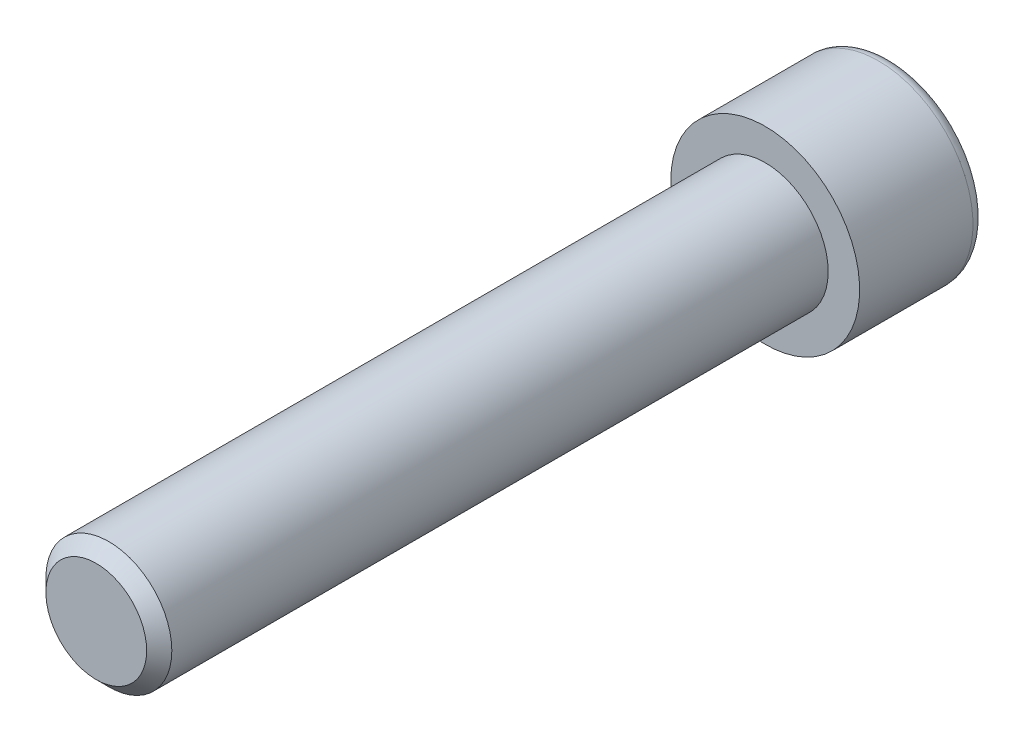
ISO-10303-21;
HEADER;
FILE_DESCRIPTION(('STEP AP214'),'2;1');
FILE_NAME('part.step','',(''),(''),'','','');
FILE_SCHEMA(('AUTOMOTIVE_DESIGN { 1 0 10303 214 1 1 1 1 }'));
ENDSEC;
DATA;
#1=APPLICATION_CONTEXT('core data for automotive mechanical design processes');
#2=APPLICATION_PROTOCOL_DEFINITION('international standard','automotive_design',2000,#1);
#3=PRODUCT_CONTEXT('',#1,'mechanical');
#4=PRODUCT('Part','Part','',(#3));
#5=PRODUCT_RELATED_PRODUCT_CATEGORY('part','',(#4));
#6=PRODUCT_DEFINITION_FORMATION('','',#4);
#7=PRODUCT_DEFINITION_CONTEXT('part definition',#1,'design');
#8=PRODUCT_DEFINITION('design','',#6,#7);
#9=PRODUCT_DEFINITION_SHAPE('','',#8);
#10=(LENGTH_UNIT() NAMED_UNIT(*) SI_UNIT(.MILLI.,.METRE.));
#11=(NAMED_UNIT(*) PLANE_ANGLE_UNIT() SI_UNIT($,.RADIAN.));
#12=(NAMED_UNIT(*) SI_UNIT($,.STERADIAN.) SOLID_ANGLE_UNIT());
#13=UNCERTAINTY_MEASURE_WITH_UNIT(LENGTH_MEASURE(1.E-05),#10,'distance_accuracy_value','');
#14=(GEOMETRIC_REPRESENTATION_CONTEXT(3) GLOBAL_UNCERTAINTY_ASSIGNED_CONTEXT((#13)) GLOBAL_UNIT_ASSIGNED_CONTEXT((#10,
#11,#12)) REPRESENTATION_CONTEXT('',''));
#15=CARTESIAN_POINT('',(0.,0.,0.));
#16=DIRECTION('',(0.,0.,1.));
#17=DIRECTION('',(1.,0.,0.));
#18=AXIS2_PLACEMENT_3D('',#15,#16,#17);
#19=CARTESIAN_POINT('',(0.,0.,-16.));
#20=DIRECTION('',(0.,0.,1.));
#21=DIRECTION('',(1.,0.,0.));
#22=AXIS2_PLACEMENT_3D('',#19,#20,#21);
#23=PLANE('',#22);
#24=CARTESIAN_POINT('',(0.,0.,-16.));
#25=DIRECTION('',(0.,0.,-1.));
#26=DIRECTION('',(-1.,0.,0.));
#27=AXIS2_PLACEMENT_3D('',#24,#25,#26);
#28=CIRCLE('',#27,10.4);
#29=CARTESIAN_POINT('',(-10.4,0.,-16.));
#30=VERTEX_POINT('',#29);
#31=EDGE_CURVE('E141',#30,#30,#28,.T.);
#32=ORIENTED_EDGE('',*,*,#31,.T.);
#33=EDGE_LOOP('',(#32));
#34=FACE_BOUND('',#33,.T.);
#35=DIRECTION('',(-0.86602540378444,0.499999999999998,0.));
#36=VECTOR('',#35,1.);
#37=CARTESIAN_POINT('',(0.,8.08290376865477,-16.));
#38=LINE('',#37,#36);
#39=CARTESIAN_POINT('',(7.,4.0414518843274,-16.));
#40=VERTEX_POINT('',#39);
#41=CARTESIAN_POINT('',(0.,8.08290376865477,-16.));
#42=VERTEX_POINT('',#41);
#43=EDGE_CURVE('E45',#40,#42,#38,.T.);
#44=ORIENTED_EDGE('',*,*,#43,.T.);
#45=DIRECTION('',(-0.866025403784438,-0.500000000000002,0.));
#46=VECTOR('',#45,1.);
#47=CARTESIAN_POINT('',(0.,8.08290376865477,-16.));
#48=LINE('',#47,#46);
#49=CARTESIAN_POINT('',(-7.,4.0414518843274,-16.));
#50=VERTEX_POINT('',#49);
#51=EDGE_CURVE('E85',#42,#50,#48,.T.);
#52=ORIENTED_EDGE('',*,*,#51,.T.);
#53=DIRECTION('',(0.,-1.,0.));
#54=VECTOR('',#53,1.);
#55=CARTESIAN_POINT('',(-7.,-4.0414518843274,-16.));
#56=LINE('',#55,#54);
#57=CARTESIAN_POINT('',(-7.,-4.0414518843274,-16.));
#58=VERTEX_POINT('',#57);
#59=EDGE_CURVE('E93',#50,#58,#56,.T.);
#60=ORIENTED_EDGE('',*,*,#59,.T.);
#61=DIRECTION('',(0.866025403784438,-0.500000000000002,0.));
#62=VECTOR('',#61,1.);
#63=CARTESIAN_POINT('',(0.,-8.08290376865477,-16.));
#64=LINE('',#63,#62);
#65=CARTESIAN_POINT('',(0.,-8.08290376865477,-16.));
#66=VERTEX_POINT('',#65);
#67=EDGE_CURVE('E111',#58,#66,#64,.T.);
#68=ORIENTED_EDGE('',*,*,#67,.T.);
#69=DIRECTION('',(0.86602540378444,0.499999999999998,0.));
#70=VECTOR('',#69,1.);
#71=CARTESIAN_POINT('',(0.,-8.08290376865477,-16.));
#72=LINE('',#71,#70);
#73=CARTESIAN_POINT('',(7.,-4.0414518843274,-16.));
#74=VERTEX_POINT('',#73);
#75=EDGE_CURVE('E114',#66,#74,#72,.T.);
#76=ORIENTED_EDGE('',*,*,#75,.T.);
#77=DIRECTION('',(0.,1.,0.));
#78=VECTOR('',#77,1.);
#79=CARTESIAN_POINT('',(7.,-4.0414518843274,-16.));
#80=LINE('',#79,#78);
#81=EDGE_CURVE('E104',#74,#40,#80,.T.);
#82=ORIENTED_EDGE('',*,*,#81,.T.);
#83=EDGE_LOOP('',(#44,#52,#60,#68,#76,#82));
#84=FACE_BOUND('',#83,.T.);
#85=ADVANCED_FACE('F31',(#34,#84),#23,.F.);
#86=CARTESIAN_POINT('',(0.,0.,-14.4));
#87=DIRECTION('',(0.,0.,-1.));
#88=DIRECTION('',(-1.,0.,0.));
#89=AXIS2_PLACEMENT_3D('',#86,#87,#88);
#90=TOROIDAL_SURFACE('',#89,10.4,1.6);
#91=ORIENTED_EDGE('',*,*,#31,.F.);
#92=EDGE_LOOP('',(#91));
#93=FACE_BOUND('',#92,.T.);
#94=CARTESIAN_POINT('',(0.,0.,-14.4));
#95=DIRECTION('',(0.,0.,-1.));
#96=DIRECTION('',(-1.,0.,0.));
#97=AXIS2_PLACEMENT_3D('',#94,#95,#96);
#98=CIRCLE('',#97,12.);
#99=CARTESIAN_POINT('',(-12.,0.,-14.4));
#100=VERTEX_POINT('',#99);
#101=EDGE_CURVE('E138',#100,#100,#98,.T.);
#102=ORIENTED_EDGE('',*,*,#101,.T.);
#103=EDGE_LOOP('',(#102));
#104=FACE_BOUND('',#103,.T.);
#105=ADVANCED_FACE('F160',(#93,#104),#90,.T.);
#106=CARTESIAN_POINT('',(0.,0.,0.));
#107=DIRECTION('',(0.,0.,-1.));
#108=DIRECTION('',(-1.,0.,0.));
#109=AXIS2_PLACEMENT_3D('',#106,#107,#108);
#110=CYLINDRICAL_SURFACE('',#109,12.);
#111=ORIENTED_EDGE('',*,*,#101,.F.);
#112=EDGE_LOOP('',(#111));
#113=FACE_BOUND('',#112,.T.);
#114=CARTESIAN_POINT('',(0.,0.,0.));
#115=DIRECTION('',(0.,0.,-1.));
#116=DIRECTION('',(-1.,0.,0.));
#117=AXIS2_PLACEMENT_3D('',#114,#115,#116);
#118=CIRCLE('',#117,12.);
#119=CARTESIAN_POINT('',(-12.,0.,0.));
#120=VERTEX_POINT('',#119);
#121=EDGE_CURVE('E99',#120,#120,#118,.T.);
#122=ORIENTED_EDGE('',*,*,#121,.T.);
#123=EDGE_LOOP('',(#122));
#124=FACE_BOUND('',#123,.T.);
#125=ADVANCED_FACE('F165',(#113,#124),#110,.T.);
#126=CARTESIAN_POINT('',(0.,0.,0.));
#127=DIRECTION('',(0.,0.,-1.));
#128=DIRECTION('',(-1.,0.,0.));
#129=AXIS2_PLACEMENT_3D('',#126,#127,#128);
#130=PLANE('',#129);
#131=CARTESIAN_POINT('',(0.,0.,0.));
#132=DIRECTION('',(0.,0.,1.));
#133=DIRECTION('',(1.,0.,0.));
#134=AXIS2_PLACEMENT_3D('',#131,#132,#133);
#135=CIRCLE('',#134,8.);
#136=CARTESIAN_POINT('',(8.,0.,0.));
#137=VERTEX_POINT('',#136);
#138=EDGE_CURVE('E105',#137,#137,#135,.T.);
#139=ORIENTED_EDGE('',*,*,#138,.F.);
#140=EDGE_LOOP('',(#139));
#141=FACE_BOUND('',#140,.T.);
#142=ORIENTED_EDGE('',*,*,#121,.F.);
#143=EDGE_LOOP('',(#142));
#144=FACE_BOUND('',#143,.T.);
#145=ADVANCED_FACE('F173',(#141,#144),#130,.F.);
#146=CARTESIAN_POINT('',(0.,8.08290376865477,-8.));
#147=DIRECTION('',(-0.499999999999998,-0.86602540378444,0.));
#148=DIRECTION('',(0.86602540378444,-0.499999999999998,0.));
#149=AXIS2_PLACEMENT_3D('',#146,#147,#148);
#150=PLANE('',#149);
#151=ORIENTED_EDGE('',*,*,#43,.F.);
#152=DIRECTION('',(0.,0.,-1.));
#153=VECTOR('',#152,1.);
#154=CARTESIAN_POINT('',(7.,4.0414518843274,-8.));
#155=LINE('',#154,#153);
#156=CARTESIAN_POINT('',(7.,4.0414518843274,-8.));
#157=VERTEX_POINT('',#156);
#158=EDGE_CURVE('E127',#157,#40,#155,.T.);
#159=ORIENTED_EDGE('',*,*,#158,.F.);
#160=DIRECTION('',(-0.86602540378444,0.499999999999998,0.));
#161=VECTOR('',#160,1.);
#162=CARTESIAN_POINT('',(0.,8.08290376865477,-8.));
#163=LINE('',#162,#161);
#164=CARTESIAN_POINT('',(0.,8.08290376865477,-8.));
#165=VERTEX_POINT('',#164);
#166=EDGE_CURVE('E98',#157,#165,#163,.T.);
#167=ORIENTED_EDGE('',*,*,#166,.T.);
#168=DIRECTION('',(0.,0.,-1.));
#169=VECTOR('',#168,1.);
#170=CARTESIAN_POINT('',(0.,8.08290376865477,-8.));
#171=LINE('',#170,#169);
#172=EDGE_CURVE('E87',#165,#42,#171,.T.);
#173=ORIENTED_EDGE('',*,*,#172,.T.);
#174=EDGE_LOOP('',(#151,#159,#167,#173));
#175=FACE_BOUND('',#174,.T.);
#176=ADVANCED_FACE('F96',(#175),#150,.T.);
#177=CARTESIAN_POINT('',(0.,8.08290376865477,-8.));
#178=DIRECTION('',(0.500000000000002,-0.866025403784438,0.));
#179=DIRECTION('',(0.866025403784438,0.500000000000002,0.));
#180=AXIS2_PLACEMENT_3D('',#177,#178,#179);
#181=PLANE('',#180);
#182=ORIENTED_EDGE('',*,*,#51,.F.);
#183=ORIENTED_EDGE('',*,*,#172,.F.);
#184=DIRECTION('',(-0.866025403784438,-0.500000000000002,0.));
#185=VECTOR('',#184,1.);
#186=CARTESIAN_POINT('',(0.,8.08290376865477,-8.));
#187=LINE('',#186,#185);
#188=CARTESIAN_POINT('',(-7.,4.0414518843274,-8.));
#189=VERTEX_POINT('',#188);
#190=EDGE_CURVE('E118',#165,#189,#187,.T.);
#191=ORIENTED_EDGE('',*,*,#190,.T.);
#192=DIRECTION('',(0.,0.,-1.));
#193=VECTOR('',#192,1.);
#194=CARTESIAN_POINT('',(-7.,4.0414518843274,-8.));
#195=LINE('',#194,#193);
#196=EDGE_CURVE('E89',#189,#50,#195,.T.);
#197=ORIENTED_EDGE('',*,*,#196,.T.);
#198=EDGE_LOOP('',(#182,#183,#191,#197));
#199=FACE_BOUND('',#198,.T.);
#200=ADVANCED_FACE('F86',(#199),#181,.T.);
#201=CARTESIAN_POINT('',(-7.,-4.0414518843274,-8.));
#202=DIRECTION('',(1.,0.,0.));
#203=DIRECTION('',(0.,0.,-1.));
#204=AXIS2_PLACEMENT_3D('',#201,#202,#203);
#205=PLANE('',#204);
#206=ORIENTED_EDGE('',*,*,#59,.F.);
#207=ORIENTED_EDGE('',*,*,#196,.F.);
#208=DIRECTION('',(0.,-1.,0.));
#209=VECTOR('',#208,1.);
#210=CARTESIAN_POINT('',(-7.,-4.0414518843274,-8.));
#211=LINE('',#210,#209);
#212=CARTESIAN_POINT('',(-7.,-4.0414518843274,-8.));
#213=VERTEX_POINT('',#212);
#214=EDGE_CURVE('E120',#189,#213,#211,.T.);
#215=ORIENTED_EDGE('',*,*,#214,.T.);
#216=DIRECTION('',(0.,0.,-1.));
#217=VECTOR('',#216,1.);
#218=CARTESIAN_POINT('',(-7.,-4.0414518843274,-8.));
#219=LINE('',#218,#217);
#220=EDGE_CURVE('E133',#213,#58,#219,.T.);
#221=ORIENTED_EDGE('',*,*,#220,.T.);
#222=EDGE_LOOP('',(#206,#207,#215,#221));
#223=FACE_BOUND('',#222,.T.);
#224=ADVANCED_FACE('F188',(#223),#205,.T.);
#225=CARTESIAN_POINT('',(0.,-8.08290376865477,-8.));
#226=DIRECTION('',(0.500000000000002,0.866025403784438,0.));
#227=DIRECTION('',(-0.866025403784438,0.500000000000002,0.));
#228=AXIS2_PLACEMENT_3D('',#225,#226,#227);
#229=PLANE('',#228);
#230=ORIENTED_EDGE('',*,*,#67,.F.);
#231=ORIENTED_EDGE('',*,*,#220,.F.);
#232=DIRECTION('',(0.866025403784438,-0.500000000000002,0.));
#233=VECTOR('',#232,1.);
#234=CARTESIAN_POINT('',(0.,-8.08290376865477,-8.));
#235=LINE('',#234,#233);
#236=CARTESIAN_POINT('',(0.,-8.08290376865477,-8.));
#237=VERTEX_POINT('',#236);
#238=EDGE_CURVE('E122',#213,#237,#235,.T.);
#239=ORIENTED_EDGE('',*,*,#238,.T.);
#240=DIRECTION('',(0.,0.,-1.));
#241=VECTOR('',#240,1.);
#242=CARTESIAN_POINT('',(0.,-8.08290376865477,-8.));
#243=LINE('',#242,#241);
#244=EDGE_CURVE('E131',#237,#66,#243,.T.);
#245=ORIENTED_EDGE('',*,*,#244,.T.);
#246=EDGE_LOOP('',(#230,#231,#239,#245));
#247=FACE_BOUND('',#246,.T.);
#248=ADVANCED_FACE('F191',(#247),#229,.T.);
#249=CARTESIAN_POINT('',(0.,-8.08290376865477,-8.));
#250=DIRECTION('',(-0.499999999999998,0.86602540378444,0.));
#251=DIRECTION('',(-0.86602540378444,-0.499999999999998,0.));
#252=AXIS2_PLACEMENT_3D('',#249,#250,#251);
#253=PLANE('',#252);
#254=ORIENTED_EDGE('',*,*,#75,.F.);
#255=ORIENTED_EDGE('',*,*,#244,.F.);
#256=DIRECTION('',(0.86602540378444,0.499999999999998,0.));
#257=VECTOR('',#256,1.);
#258=CARTESIAN_POINT('',(0.,-8.08290376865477,-8.));
#259=LINE('',#258,#257);
#260=CARTESIAN_POINT('',(7.,-4.0414518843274,-8.));
#261=VERTEX_POINT('',#260);
#262=EDGE_CURVE('E124',#237,#261,#259,.T.);
#263=ORIENTED_EDGE('',*,*,#262,.T.);
#264=DIRECTION('',(0.,0.,-1.));
#265=VECTOR('',#264,1.);
#266=CARTESIAN_POINT('',(7.,-4.0414518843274,-8.));
#267=LINE('',#266,#265);
#268=EDGE_CURVE('E129',#261,#74,#267,.T.);
#269=ORIENTED_EDGE('',*,*,#268,.T.);
#270=EDGE_LOOP('',(#254,#255,#263,#269));
#271=FACE_BOUND('',#270,.T.);
#272=ADVANCED_FACE('F195',(#271),#253,.T.);
#273=CARTESIAN_POINT('',(7.,-4.0414518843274,-8.));
#274=DIRECTION('',(-1.,0.,0.));
#275=DIRECTION('',(0.,0.,1.));
#276=AXIS2_PLACEMENT_3D('',#273,#274,#275);
#277=PLANE('',#276);
#278=ORIENTED_EDGE('',*,*,#81,.F.);
#279=ORIENTED_EDGE('',*,*,#268,.F.);
#280=DIRECTION('',(0.,1.,0.));
#281=VECTOR('',#280,1.);
#282=CARTESIAN_POINT('',(7.,-4.0414518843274,-8.));
#283=LINE('',#282,#281);
#284=EDGE_CURVE('E52',#261,#157,#283,.T.);
#285=ORIENTED_EDGE('',*,*,#284,.T.);
#286=ORIENTED_EDGE('',*,*,#158,.T.);
#287=EDGE_LOOP('',(#278,#279,#285,#286));
#288=FACE_BOUND('',#287,.T.);
#289=ADVANCED_FACE('F199',(#288),#277,.T.);
#290=CARTESIAN_POINT('',(7.,4.0414518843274,-8.));
#291=DIRECTION('',(0.,0.,1.));
#292=DIRECTION('',(1.,0.,0.));
#293=AXIS2_PLACEMENT_3D('',#290,#291,#292);
#294=PLANE('',#293);
#295=ORIENTED_EDGE('',*,*,#166,.F.);
#296=ORIENTED_EDGE('',*,*,#284,.F.);
#297=ORIENTED_EDGE('',*,*,#262,.F.);
#298=ORIENTED_EDGE('',*,*,#238,.F.);
#299=ORIENTED_EDGE('',*,*,#214,.F.);
#300=ORIENTED_EDGE('',*,*,#190,.F.);
#301=EDGE_LOOP('',(#295,#296,#297,#298,#299,#300));
#302=FACE_BOUND('',#301,.T.);
#303=ADVANCED_FACE('F203',(#302),#294,.F.);
#304=CARTESIAN_POINT('',(0.,0.,85.));
#305=DIRECTION('',(0.,0.,1.));
#306=DIRECTION('',(1.,0.,0.));
#307=AXIS2_PLACEMENT_3D('',#304,#305,#306);
#308=PLANE('',#307);
#309=CARTESIAN_POINT('',(0.,0.,85.));
#310=DIRECTION('',(0.,0.,1.));
#311=DIRECTION('',(1.,0.,0.));
#312=AXIS2_PLACEMENT_3D('',#309,#310,#311);
#313=CIRCLE('',#312,6.39999999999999);
#314=CARTESIAN_POINT('',(6.4,0.,85.));
#315=VERTEX_POINT('',#314);
#316=EDGE_CURVE('E38',#315,#315,#313,.T.);
#317=ORIENTED_EDGE('',*,*,#316,.T.);
#318=EDGE_LOOP('',(#317));
#319=FACE_BOUND('',#318,.T.);
#320=ADVANCED_FACE('F146',(#319),#308,.T.);
#321=CARTESIAN_POINT('',(0.,0.,0.));
#322=DIRECTION('',(0.,0.,1.));
#323=DIRECTION('',(1.,0.,0.));
#324=AXIS2_PLACEMENT_3D('',#321,#322,#323);
#325=CYLINDRICAL_SURFACE('',#324,8.);
#326=CARTESIAN_POINT('',(0.,0.,83.4));
#327=DIRECTION('',(0.,0.,1.));
#328=DIRECTION('',(1.,0.,0.));
#329=AXIS2_PLACEMENT_3D('',#326,#327,#328);
#330=CIRCLE('',#329,8.);
#331=CARTESIAN_POINT('',(8.00000000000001,0.,83.4));
#332=VERTEX_POINT('',#331);
#333=EDGE_CURVE('E11',#332,#332,#330,.F.);
#334=ORIENTED_EDGE('',*,*,#333,.T.);
#335=EDGE_LOOP('',(#334));
#336=FACE_BOUND('',#335,.T.);
#337=ORIENTED_EDGE('',*,*,#138,.T.);
#338=EDGE_LOOP('',(#337));
#339=FACE_BOUND('',#338,.T.);
#340=ADVANCED_FACE('F150',(#336,#339),#325,.T.);
#341=CARTESIAN_POINT('',(0.,0.,85.));
#342=DIRECTION('',(0.,0.,-1.));
#343=DIRECTION('',(-1.,0.,0.));
#344=AXIS2_PLACEMENT_3D('',#341,#342,#343);
#345=CONICAL_SURFACE('',#344,6.39999999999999,0.785398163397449);
#346=ORIENTED_EDGE('',*,*,#333,.F.);
#347=EDGE_LOOP('',(#346));
#348=FACE_BOUND('',#347,.T.);
#349=ORIENTED_EDGE('',*,*,#316,.F.);
#350=EDGE_LOOP('',(#349));
#351=FACE_BOUND('',#350,.T.);
#352=ADVANCED_FACE('F148',(#348,#351),#345,.T.);
#353=CLOSED_SHELL('',(#85,#105,#125,#145,#176,#200,#224,#248,#272,#289,#303,#320,#340,#352));
#354=MANIFOLD_SOLID_BREP('B2',#353);
#355=ADVANCED_BREP_SHAPE_REPRESENTATION('',(#18,#354),#14);
#356=SHAPE_DEFINITION_REPRESENTATION(#9,#355);
ENDSEC;
END-ISO-10303-21;
